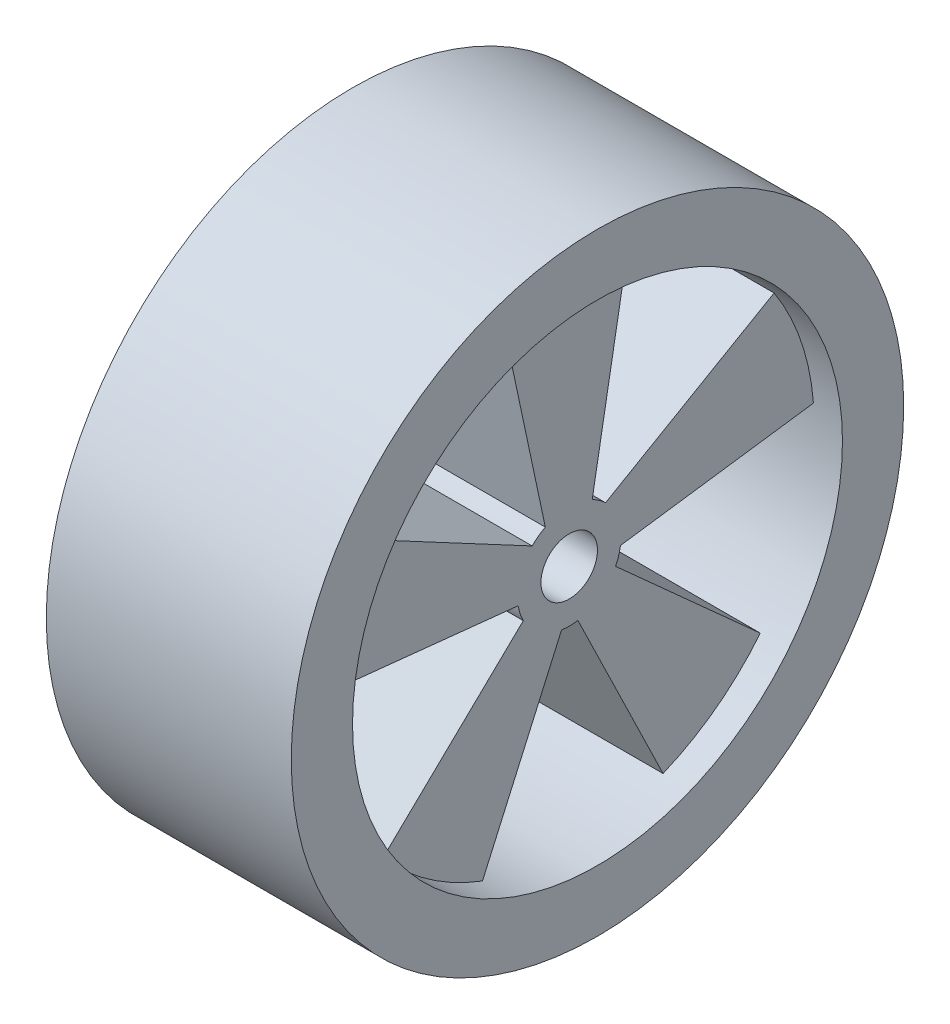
ISO-10303-21;
HEADER;
FILE_DESCRIPTION(('STEP AP214'),'2;1');
FILE_NAME('part.step','',(''),(''),'','','');
FILE_SCHEMA(('AUTOMOTIVE_DESIGN { 1 0 10303 214 1 1 1 1 }'));
ENDSEC;
DATA;
#1=APPLICATION_CONTEXT('core data for automotive mechanical design processes');
#2=APPLICATION_PROTOCOL_DEFINITION('international standard','automotive_design',2000,#1);
#3=PRODUCT_CONTEXT('',#1,'mechanical');
#4=PRODUCT('Part','Part','',(#3));
#5=PRODUCT_RELATED_PRODUCT_CATEGORY('part','',(#4));
#6=PRODUCT_DEFINITION_FORMATION('','',#4);
#7=PRODUCT_DEFINITION_CONTEXT('part definition',#1,'design');
#8=PRODUCT_DEFINITION('design','',#6,#7);
#9=PRODUCT_DEFINITION_SHAPE('','',#8);
#10=(LENGTH_UNIT() NAMED_UNIT(*) SI_UNIT(.MILLI.,.METRE.));
#11=(NAMED_UNIT(*) PLANE_ANGLE_UNIT() SI_UNIT($,.RADIAN.));
#12=(NAMED_UNIT(*) SI_UNIT($,.STERADIAN.) SOLID_ANGLE_UNIT());
#13=UNCERTAINTY_MEASURE_WITH_UNIT(LENGTH_MEASURE(1.E-05),#10,'distance_accuracy_value','');
#14=(GEOMETRIC_REPRESENTATION_CONTEXT(3) GLOBAL_UNCERTAINTY_ASSIGNED_CONTEXT((#13)) GLOBAL_UNIT_ASSIGNED_CONTEXT((#10,
#11,#12)) REPRESENTATION_CONTEXT('',''));
#15=CARTESIAN_POINT('',(0.,0.,0.));
#16=DIRECTION('',(0.,0.,1.));
#17=DIRECTION('',(1.,0.,0.));
#18=AXIS2_PLACEMENT_3D('',#15,#16,#17);
#19=CARTESIAN_POINT('',(78.,-2.97640639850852,-6.69374221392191));
#20=DIRECTION('',(0.,0.406299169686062,0.913740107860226));
#21=DIRECTION('',(0.,-0.913740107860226,0.406299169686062));
#22=AXIS2_PLACEMENT_3D('',#19,#20,#21);
#23=PLANE('',#22);
#24=DIRECTION('',(0.,0.913740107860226,-0.406299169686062));
#25=VECTOR('',#24,1.);
#26=CARTESIAN_POINT('',(63.,-2.97640639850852,-6.69374221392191));
#27=LINE('',#26,#25);
#28=CARTESIAN_POINT('',(63.,-121.573870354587,46.0412211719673));
#29=VERTEX_POINT('',#28);
#30=CARTESIAN_POINT('',(63.,-27.1962909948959,4.07575221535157));
#31=VERTEX_POINT('',#30);
#32=EDGE_CURVE('E333',#29,#31,#27,.T.);
#33=ORIENTED_EDGE('',*,*,#32,.F.);
#34=DIRECTION('',(-1.,0.,0.));
#35=VECTOR('',#34,1.);
#36=CARTESIAN_POINT('',(78.,-121.573870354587,46.0412211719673));
#37=LINE('',#36,#35);
#38=CARTESIAN_POINT('',(-37.,-121.573870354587,46.0412211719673));
#39=VERTEX_POINT('',#38);
#40=EDGE_CURVE('E270',#29,#39,#37,.T.);
#41=ORIENTED_EDGE('',*,*,#40,.T.);
#42=DIRECTION('',(0.,0.913740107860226,-0.406299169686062));
#43=VECTOR('',#42,1.);
#44=CARTESIAN_POINT('',(-37.,-2.97640639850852,-6.69374221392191));
#45=LINE('',#44,#43);
#46=CARTESIAN_POINT('',(-37.,-27.1962909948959,4.07575221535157));
#47=VERTEX_POINT('',#46);
#48=EDGE_CURVE('E344',#39,#47,#45,.T.);
#49=ORIENTED_EDGE('',*,*,#48,.T.);
#50=DIRECTION('',(-1.,0.,0.));
#51=VECTOR('',#50,1.);
#52=CARTESIAN_POINT('',(78.,-27.1962909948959,4.07575221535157));
#53=LINE('',#52,#51);
#54=EDGE_CURVE('E12',#31,#47,#53,.T.);
#55=ORIENTED_EDGE('',*,*,#54,.F.);
#56=EDGE_LOOP('',(#33,#41,#49,#55));
#57=FACE_BOUND('',#56,.T.);
#58=ADVANCED_FACE('F42',(#57),#23,.F.);
#59=CARTESIAN_POINT('',(78.,0.,0.));
#60=DIRECTION('',(-1.,0.,0.));
#61=DIRECTION('',(0.,0.,1.));
#62=AXIS2_PLACEMENT_3D('',#59,#60,#61);
#63=CYLINDRICAL_SURFACE('',#62,27.5);
#64=CARTESIAN_POINT('',(63.,0.,0.));
#65=DIRECTION('',(1.,0.,0.));
#66=DIRECTION('',(0.,0.,-1.));
#67=AXIS2_PLACEMENT_3D('',#64,#65,#66);
#68=CIRCLE('',#67,27.5);
#69=CARTESIAN_POINT('',(63.,-27.1115849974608,-4.60564424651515));
#70=VERTEX_POINT('',#69);
#71=EDGE_CURVE('E331',#31,#70,#68,.T.);
#72=ORIENTED_EDGE('',*,*,#71,.F.);
#73=ORIENTED_EDGE('',*,*,#54,.T.);
#74=CARTESIAN_POINT('',(-37.,0.,0.));
#75=DIRECTION('',(1.,0.,0.));
#76=DIRECTION('',(0.,0.,-1.));
#77=AXIS2_PLACEMENT_3D('',#74,#75,#76);
#78=CIRCLE('',#77,27.5);
#79=CARTESIAN_POINT('',(-37.,-27.1115849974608,-4.60564424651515));
#80=VERTEX_POINT('',#79);
#81=EDGE_CURVE('E337',#47,#80,#78,.T.);
#82=ORIENTED_EDGE('',*,*,#81,.T.);
#83=DIRECTION('',(-1.,0.,0.));
#84=VECTOR('',#83,1.);
#85=CARTESIAN_POINT('',(78.,-27.1115849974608,-4.60564424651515));
#86=LINE('',#85,#84);
#87=EDGE_CURVE('E51',#70,#80,#86,.T.);
#88=ORIENTED_EDGE('',*,*,#87,.F.);
#89=EDGE_LOOP('',(#72,#73,#82,#88));
#90=FACE_BOUND('',#89,.T.);
#91=ADVANCED_FACE('F401',(#90),#63,.T.);
#92=CARTESIAN_POINT('',(78.,-3.37102331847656,6.93476288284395));
#93=DIRECTION('',(0.,-0.437188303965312,0.899369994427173));
#94=DIRECTION('',(0.,-0.899369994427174,-0.437188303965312));
#95=AXIS2_PLACEMENT_3D('',#92,#93,#94);
#96=PLANE('',#95);
#97=DIRECTION('',(-1.,0.,0.));
#98=VECTOR('',#97,1.);
#99=CARTESIAN_POINT('',(78.,-120.083280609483,-49.7996558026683));
#100=LINE('',#99,#98);
#101=CARTESIAN_POINT('',(63.,-120.083280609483,-49.7996558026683));
#102=VERTEX_POINT('',#101);
#103=CARTESIAN_POINT('',(-37.,-120.083280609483,-49.7996558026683));
#104=VERTEX_POINT('',#103);
#105=EDGE_CURVE('E272',#102,#104,#100,.T.);
#106=ORIENTED_EDGE('',*,*,#105,.F.);
#107=DIRECTION('',(0.,0.899369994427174,0.437188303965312));
#108=VECTOR('',#107,1.);
#109=CARTESIAN_POINT('',(63.,-3.37102331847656,6.93476288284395));
#110=LINE('',#109,#108);
#111=EDGE_CURVE('E328',#102,#70,#110,.T.);
#112=ORIENTED_EDGE('',*,*,#111,.T.);
#113=ORIENTED_EDGE('',*,*,#87,.T.);
#114=DIRECTION('',(0.,0.899369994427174,0.437188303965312));
#115=VECTOR('',#114,1.);
#116=CARTESIAN_POINT('',(-37.,-3.37102331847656,6.93476288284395));
#117=LINE('',#116,#115);
#118=EDGE_CURVE('E338',#104,#80,#117,.T.);
#119=ORIENTED_EDGE('',*,*,#118,.F.);
#120=EDGE_LOOP('',(#106,#112,#113,#119));
#121=FACE_BOUND('',#120,.T.);
#122=ADVANCED_FACE('F396',(#121),#96,.T.);
#123=CARTESIAN_POINT('',(78.,-7.28588731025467,0.762250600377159));
#124=DIRECTION('',(0.,0.994571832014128,-0.104052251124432));
#125=DIRECTION('',(0.,0.104052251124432,0.994571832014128));
#126=AXIS2_PLACEMENT_3D('',#123,#124,#125);
#127=PLANE('',#126);
#128=DIRECTION('',(0.,-0.104052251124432,-0.994571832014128));
#129=VECTOR('',#128,1.);
#130=CARTESIAN_POINT('',(63.,-7.28588731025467,0.762250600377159));
#131=LINE('',#130,#129);
#132=CARTESIAN_POINT('',(63.,6.219411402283,129.851141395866));
#133=VERTEX_POINT('',#132);
#134=CARTESIAN_POINT('',(63.,-4.52784539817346,27.1246864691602));
#135=VERTEX_POINT('',#134);
#136=EDGE_CURVE('E326',#133,#135,#131,.T.);
#137=ORIENTED_EDGE('',*,*,#136,.F.);
#138=DIRECTION('',(-1.,0.,0.));
#139=VECTOR('',#138,1.);
#140=CARTESIAN_POINT('',(78.,6.219411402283,129.851141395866));
#141=LINE('',#140,#139);
#142=CARTESIAN_POINT('',(-37.,6.219411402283,129.851141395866));
#143=VERTEX_POINT('',#142);
#144=EDGE_CURVE('E275',#133,#143,#141,.T.);
#145=ORIENTED_EDGE('',*,*,#144,.T.);
#146=DIRECTION('',(0.,-0.104052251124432,-0.994571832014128));
#147=VECTOR('',#146,1.);
#148=CARTESIAN_POINT('',(-37.,-7.28588731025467,0.762250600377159));
#149=LINE('',#148,#147);
#150=CARTESIAN_POINT('',(-37.,-4.52784539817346,27.1246864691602));
#151=VERTEX_POINT('',#150);
#152=EDGE_CURVE('E256',#143,#151,#149,.T.);
#153=ORIENTED_EDGE('',*,*,#152,.T.);
#154=DIRECTION('',(-1.,0.,0.));
#155=VECTOR('',#154,1.);
#156=CARTESIAN_POINT('',(78.,-4.52784539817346,27.1246864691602));
#157=LINE('',#156,#155);
#158=EDGE_CURVE('E59',#135,#151,#157,.T.);
#159=ORIENTED_EDGE('',*,*,#158,.F.);
#160=EDGE_LOOP('',(#137,#145,#153,#159));
#161=FACE_BOUND('',#160,.T.);
#162=ADVANCED_FACE('F412',(#161),#127,.F.);
#163=CARTESIAN_POINT('',(63.,0.,0.));
#164=DIRECTION('',(1.,0.,0.));
#165=DIRECTION('',(0.,0.,-1.));
#166=AXIS2_PLACEMENT_3D('',#163,#164,#165);
#167=CIRCLE('',#166,27.5);
#168=CARTESIAN_POINT('',(63.,-12.7581684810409,24.3614272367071));
#169=VERTEX_POINT('',#168);
#170=EDGE_CURVE('E324',#135,#169,#167,.T.);
#171=ORIENTED_EDGE('',*,*,#170,.F.);
#172=ORIENTED_EDGE('',*,*,#158,.T.);
#173=CARTESIAN_POINT('',(-37.,0.,0.));
#174=DIRECTION('',(1.,0.,0.));
#175=DIRECTION('',(0.,0.,-1.));
#176=AXIS2_PLACEMENT_3D('',#173,#174,#175);
#177=CIRCLE('',#176,27.5);
#178=CARTESIAN_POINT('',(-37.,-12.7581684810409,24.3614272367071));
#179=VERTEX_POINT('',#178);
#180=EDGE_CURVE('E254',#151,#179,#177,.T.);
#181=ORIENTED_EDGE('',*,*,#180,.T.);
#182=DIRECTION('',(-1.,0.,0.));
#183=VECTOR('',#182,1.);
#184=CARTESIAN_POINT('',(78.,-12.7581684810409,24.3614272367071));
#185=LINE('',#184,#183);
#186=EDGE_CURVE('E67',#169,#179,#185,.T.);
#187=ORIENTED_EDGE('',*,*,#186,.F.);
#188=EDGE_LOOP('',(#171,#172,#181,#187));
#189=FACE_BOUND('',#188,.T.);
#190=ADVANCED_FACE('F414',(#189),#63,.T.);
#191=CARTESIAN_POINT('',(78.,5.55364793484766,5.34899327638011));
#192=DIRECTION('',(0.,0.720253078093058,0.693711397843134));
#193=DIRECTION('',(0.,-0.693711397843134,0.720253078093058));
#194=AXIS2_PLACEMENT_3D('',#191,#192,#193);
#195=PLANE('',#194);
#196=DIRECTION('',(-1.,0.,0.));
#197=VECTOR('',#196,1.);
#198=CARTESIAN_POINT('',(78.,-84.4700616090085,98.8170465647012));
#199=LINE('',#198,#197);
#200=CARTESIAN_POINT('',(63.,-84.4700616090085,98.8170465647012));
#201=VERTEX_POINT('',#200);
#202=CARTESIAN_POINT('',(-37.,-84.4700616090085,98.8170465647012));
#203=VERTEX_POINT('',#202);
#204=EDGE_CURVE('E277',#201,#203,#199,.T.);
#205=ORIENTED_EDGE('',*,*,#204,.F.);
#206=DIRECTION('',(0.,0.693711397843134,-0.720253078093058));
#207=VECTOR('',#206,1.);
#208=CARTESIAN_POINT('',(63.,5.55364793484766,5.34899327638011));
#209=LINE('',#208,#207);
#210=EDGE_CURVE('E322',#201,#169,#209,.T.);
#211=ORIENTED_EDGE('',*,*,#210,.T.);
#212=ORIENTED_EDGE('',*,*,#186,.T.);
#213=DIRECTION('',(0.,0.693711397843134,-0.720253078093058));
#214=VECTOR('',#213,1.);
#215=CARTESIAN_POINT('',(-37.,5.55364793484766,5.34899327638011));
#216=LINE('',#215,#214);
#217=EDGE_CURVE('E252',#203,#179,#216,.T.);
#218=ORIENTED_EDGE('',*,*,#217,.F.);
#219=EDGE_LOOP('',(#205,#211,#212,#218));
#220=FACE_BOUND('',#219,.T.);
#221=ADVANCED_FACE('F406',(#220),#195,.T.);
#222=CARTESIAN_POINT('',(78.,-1.52651959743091,7.16483899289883));
#223=DIRECTION('',(0.,0.208380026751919,-0.978047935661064));
#224=DIRECTION('',(0.,0.978047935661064,0.208380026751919));
#225=AXIS2_PLACEMENT_3D('',#222,#223,#224);
#226=PLANE('',#225);
#227=DIRECTION('',(0.,-0.978047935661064,-0.208380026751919));
#228=VECTOR('',#227,1.);
#229=CARTESIAN_POINT('',(63.,-1.52651959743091,7.16483899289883));
#230=LINE('',#229,#228);
#231=CARTESIAN_POINT('',(63.,125.417677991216,34.2111976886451));
#232=VERTEX_POINT('',#231);
#233=CARTESIAN_POINT('',(63.,24.3979286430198,12.6882259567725));
#234=VERTEX_POINT('',#233);
#235=EDGE_CURVE('E320',#232,#234,#230,.T.);
#236=ORIENTED_EDGE('',*,*,#235,.F.);
#237=DIRECTION('',(-1.,0.,0.));
#238=VECTOR('',#237,1.);
#239=CARTESIAN_POINT('',(78.,125.417677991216,34.2111976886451));
#240=LINE('',#239,#238);
#241=CARTESIAN_POINT('',(-37.,125.417677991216,34.2111976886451));
#242=VERTEX_POINT('',#241);
#243=EDGE_CURVE('E282',#232,#242,#240,.T.);
#244=ORIENTED_EDGE('',*,*,#243,.T.);
#245=DIRECTION('',(0.,-0.978047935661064,-0.208380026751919));
#246=VECTOR('',#245,1.);
#247=CARTESIAN_POINT('',(-37.,-1.52651959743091,7.16483899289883));
#248=LINE('',#247,#246);
#249=CARTESIAN_POINT('',(-37.,24.3979286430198,12.6882259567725));
#250=VERTEX_POINT('',#249);
#251=EDGE_CURVE('E249',#242,#250,#248,.T.);
#252=ORIENTED_EDGE('',*,*,#251,.T.);
#253=DIRECTION('',(-1.,0.,0.));
#254=VECTOR('',#253,1.);
#255=CARTESIAN_POINT('',(78.,24.3979286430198,12.6882259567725));
#256=LINE('',#255,#254);
#257=EDGE_CURVE('E278',#234,#250,#256,.T.);
#258=ORIENTED_EDGE('',*,*,#257,.F.);
#259=EDGE_LOOP('',(#236,#244,#252,#258));
#260=FACE_BOUND('',#259,.T.);
#261=ADVANCED_FACE('F374',(#260),#226,.F.);
#262=CARTESIAN_POINT('',(63.,0.,0.));
#263=DIRECTION('',(1.,0.,0.));
#264=DIRECTION('',(0.,0.,-1.));
#265=AXIS2_PLACEMENT_3D('',#262,#263,#264);
#266=CIRCLE('',#265,27.5);
#267=CARTESIAN_POINT('',(63.,19.2266032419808,19.6618342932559));
#268=VERTEX_POINT('',#267);
#269=EDGE_CURVE('E313',#234,#268,#266,.T.);
#270=ORIENTED_EDGE('',*,*,#269,.F.);
#271=ORIENTED_EDGE('',*,*,#257,.T.);
#272=CARTESIAN_POINT('',(-37.,0.,0.));
#273=DIRECTION('',(1.,0.,0.));
#274=DIRECTION('',(0.,0.,-1.));
#275=AXIS2_PLACEMENT_3D('',#272,#273,#274);
#276=CIRCLE('',#275,27.5);
#277=CARTESIAN_POINT('',(-37.,19.2266032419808,19.6618342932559));
#278=VERTEX_POINT('',#277);
#279=EDGE_CURVE('E246',#250,#278,#276,.T.);
#280=ORIENTED_EDGE('',*,*,#279,.T.);
#281=DIRECTION('',(-1.,0.,0.));
#282=VECTOR('',#281,1.);
#283=CARTESIAN_POINT('',(78.,19.2266032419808,19.6618342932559));
#284=LINE('',#283,#282);
#285=EDGE_CURVE('E287',#268,#278,#284,.T.);
#286=ORIENTED_EDGE('',*,*,#285,.F.);
#287=EDGE_LOOP('',(#270,#271,#280,#286));
#288=FACE_BOUND('',#287,.T.);
#289=ADVANCED_FACE('F369',(#288),#63,.T.);
#290=CARTESIAN_POINT('',(78.,6.80336650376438,-3.62890323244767));
#291=DIRECTION('',(0.,0.882329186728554,-0.470632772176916));
#292=DIRECTION('',(0.,0.470632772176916,0.882329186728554));
#293=AXIS2_PLACEMENT_3D('',#290,#291,#292);
#294=PLANE('',#293);
#295=DIRECTION('',(-1.,0.,0.));
#296=VECTOR('',#295,1.);
#297=CARTESIAN_POINT('',(78.,67.8779115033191,110.871949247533));
#298=LINE('',#297,#296);
#299=CARTESIAN_POINT('',(63.,67.8779115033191,110.871949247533));
#300=VERTEX_POINT('',#299);
#301=CARTESIAN_POINT('',(-37.,67.8779115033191,110.871949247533));
#302=VERTEX_POINT('',#301);
#303=EDGE_CURVE('E284',#300,#302,#298,.T.);
#304=ORIENTED_EDGE('',*,*,#303,.F.);
#305=DIRECTION('',(0.,-0.470632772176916,-0.882329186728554));
#306=VECTOR('',#305,1.);
#307=CARTESIAN_POINT('',(63.,6.80336650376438,-3.62890323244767));
#308=LINE('',#307,#306);
#309=EDGE_CURVE('E310',#300,#268,#308,.T.);
#310=ORIENTED_EDGE('',*,*,#309,.T.);
#311=ORIENTED_EDGE('',*,*,#285,.T.);
#312=DIRECTION('',(0.,-0.470632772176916,-0.882329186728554));
#313=VECTOR('',#312,1.);
#314=CARTESIAN_POINT('',(-37.,6.80336650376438,-3.62890323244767));
#315=LINE('',#314,#313);
#316=EDGE_CURVE('E243',#302,#278,#315,.T.);
#317=ORIENTED_EDGE('',*,*,#316,.F.);
#318=EDGE_LOOP('',(#304,#310,#311,#317));
#319=FACE_BOUND('',#318,.T.);
#320=ADVANCED_FACE('F365',(#319),#294,.T.);
#321=CARTESIAN_POINT('',(78.,6.34244631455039,3.66586342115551));
#322=DIRECTION('',(0.,-0.865785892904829,-0.500414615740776));
#323=DIRECTION('',(0.,0.500414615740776,-0.865785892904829));
#324=AXIS2_PLACEMENT_3D('',#321,#322,#323);
#325=PLANE('',#324);
#326=DIRECTION('',(0.,-0.500414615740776,0.865785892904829));
#327=VECTOR('',#326,1.);
#328=CARTESIAN_POINT('',(63.,6.34244631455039,3.66586342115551));
#329=LINE('',#328,#327);
#330=CARTESIAN_POINT('',(63.,71.2929763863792,-108.707458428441));
#331=VERTEX_POINT('',#330);
#332=CARTESIAN_POINT('',(63.,19.606594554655,-19.2829315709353));
#333=VERTEX_POINT('',#332);
#334=EDGE_CURVE('E309',#331,#333,#329,.T.);
#335=ORIENTED_EDGE('',*,*,#334,.F.);
#336=DIRECTION('',(-1.,0.,0.));
#337=VECTOR('',#336,1.);
#338=CARTESIAN_POINT('',(78.,71.2929763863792,-108.707458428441));
#339=LINE('',#338,#337);
#340=CARTESIAN_POINT('',(-37.,71.2929763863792,-108.707458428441));
#341=VERTEX_POINT('',#340);
#342=EDGE_CURVE('E201',#331,#341,#339,.T.);
#343=ORIENTED_EDGE('',*,*,#342,.T.);
#344=DIRECTION('',(0.,-0.500414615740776,0.865785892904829));
#345=VECTOR('',#344,1.);
#346=CARTESIAN_POINT('',(-37.,6.34244631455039,3.66586342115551));
#347=LINE('',#346,#345);
#348=CARTESIAN_POINT('',(-37.,19.606594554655,-19.2829315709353));
#349=VERTEX_POINT('',#348);
#350=EDGE_CURVE('E240',#341,#349,#347,.T.);
#351=ORIENTED_EDGE('',*,*,#350,.T.);
#352=DIRECTION('',(-1.,0.,0.));
#353=VECTOR('',#352,1.);
#354=CARTESIAN_POINT('',(78.,19.606594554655,-19.2829315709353));
#355=LINE('',#354,#353);
#356=EDGE_CURVE('E285',#333,#349,#355,.T.);
#357=ORIENTED_EDGE('',*,*,#356,.F.);
#358=EDGE_LOOP('',(#335,#343,#351,#357));
#359=FACE_BOUND('',#358,.T.);
#360=ADVANCED_FACE('F308',(#359),#325,.F.);
#361=CARTESIAN_POINT('',(63.,0.,0.));
#362=DIRECTION('',(1.,0.,0.));
#363=DIRECTION('',(0.,0.,-1.));
#364=AXIS2_PLACEMENT_3D('',#361,#362,#363);
#365=CIRCLE('',#364,27.5);
#366=CARTESIAN_POINT('',(63.,24.6408627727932,-12.2097453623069));
#367=VERTEX_POINT('',#366);
#368=EDGE_CURVE('E300',#333,#367,#365,.T.);
#369=ORIENTED_EDGE('',*,*,#368,.F.);
#370=ORIENTED_EDGE('',*,*,#356,.T.);
#371=CARTESIAN_POINT('',(-37.,0.,0.));
#372=DIRECTION('',(1.,0.,0.));
#373=DIRECTION('',(0.,0.,-1.));
#374=AXIS2_PLACEMENT_3D('',#371,#372,#373);
#375=CIRCLE('',#374,27.5);
#376=CARTESIAN_POINT('',(-37.,24.6408627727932,-12.2097453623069));
#377=VERTEX_POINT('',#376);
#378=EDGE_CURVE('E225',#349,#377,#375,.T.);
#379=ORIENTED_EDGE('',*,*,#378,.T.);
#380=DIRECTION('',(-1.,0.,0.));
#381=VECTOR('',#380,1.);
#382=CARTESIAN_POINT('',(78.,24.6408627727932,-12.2097453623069));
#383=LINE('',#382,#381);
#384=EDGE_CURVE('E293',#367,#377,#383,.T.);
#385=ORIENTED_EDGE('',*,*,#384,.F.);
#386=EDGE_LOOP('',(#369,#370,#379,#385));
#387=FACE_BOUND('',#386,.T.);
#388=ADVANCED_FACE('F298',(#387),#63,.T.);
#389=CARTESIAN_POINT('',(78.,-1.34893619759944,-7.5917788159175));
#390=DIRECTION('',(0.,-0.174943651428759,-0.984578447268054));
#391=DIRECTION('',(0.,0.984578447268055,-0.174943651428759));
#392=AXIS2_PLACEMENT_3D('',#389,#390,#391);
#393=PLANE('',#392);
#394=DIRECTION('',(-1.,0.,0.));
#395=VECTOR('',#394,1.);
#396=CARTESIAN_POINT('',(78.,126.420918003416,-30.2944135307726));
#397=LINE('',#396,#395);
#398=CARTESIAN_POINT('',(63.,126.420918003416,-30.2944135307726));
#399=VERTEX_POINT('',#398);
#400=CARTESIAN_POINT('',(-37.,126.420918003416,-30.2944135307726));
#401=VERTEX_POINT('',#400);
#402=EDGE_CURVE('E291',#399,#401,#397,.T.);
#403=ORIENTED_EDGE('',*,*,#402,.F.);
#404=DIRECTION('',(0.,-0.984578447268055,0.174943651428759));
#405=VECTOR('',#404,1.);
#406=CARTESIAN_POINT('',(63.,-1.34893619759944,-7.5917788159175));
#407=LINE('',#406,#405);
#408=EDGE_CURVE('E315',#399,#367,#407,.T.);
#409=ORIENTED_EDGE('',*,*,#408,.T.);
#410=ORIENTED_EDGE('',*,*,#384,.T.);
#411=DIRECTION('',(0.,-0.984578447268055,0.174943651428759));
#412=VECTOR('',#411,1.);
#413=CARTESIAN_POINT('',(-37.,-1.34893619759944,-7.5917788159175));
#414=LINE('',#413,#412);
#415=EDGE_CURVE('E220',#401,#377,#414,.T.);
#416=ORIENTED_EDGE('',*,*,#415,.F.);
#417=EDGE_LOOP('',(#403,#409,#410,#416));
#418=FACE_BOUND('',#417,.T.);
#419=ADVANCED_FACE('F379',(#418),#393,.T.);
#420=CARTESIAN_POINT('',(78.,5.44636699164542,-4.89921080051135));
#421=DIRECTION('',(0.,-0.74346513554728,0.668774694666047));
#422=DIRECTION('',(0.,-0.668774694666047,-0.74346513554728));
#423=AXIS2_PLACEMENT_3D('',#420,#421,#422);
#424=PLANE('',#423);
#425=DIRECTION('',(0.,0.668774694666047,0.74346513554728));
#426=VECTOR('',#425,1.);
#427=CARTESIAN_POINT('',(63.,5.44636699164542,-4.89921080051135));
#428=LINE('',#427,#426);
#429=CARTESIAN_POINT('',(63.,-81.3561954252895,-101.396101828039));
#430=VERTEX_POINT('',#429);
#431=CARTESIAN_POINT('',(63.,-12.2803868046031,-24.6057330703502));
#432=VERTEX_POINT('',#431);
#433=EDGE_CURVE('E381',#430,#432,#428,.T.);
#434=ORIENTED_EDGE('',*,*,#433,.F.);
#435=DIRECTION('',(-1.,0.,0.));
#436=VECTOR('',#435,1.);
#437=CARTESIAN_POINT('',(78.,-81.3561954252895,-101.396101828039));
#438=LINE('',#437,#436);
#439=CARTESIAN_POINT('',(-37.,-81.3561954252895,-101.396101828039));
#440=VERTEX_POINT('',#439);
#441=EDGE_CURVE('E210',#430,#440,#438,.T.);
#442=ORIENTED_EDGE('',*,*,#441,.T.);
#443=DIRECTION('',(0.,0.668774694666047,0.74346513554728));
#444=VECTOR('',#443,1.);
#445=CARTESIAN_POINT('',(-37.,5.44636699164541,-4.89921080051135));
#446=LINE('',#445,#444);
#447=CARTESIAN_POINT('',(-37.,-12.2803868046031,-24.6057330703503));
#448=VERTEX_POINT('',#447);
#449=EDGE_CURVE('E228',#440,#448,#446,.T.);
#450=ORIENTED_EDGE('',*,*,#449,.T.);
#451=DIRECTION('',(-1.,0.,0.));
#452=VECTOR('',#451,1.);
#453=CARTESIAN_POINT('',(78.,-12.2803868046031,-24.6057330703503));
#454=LINE('',#453,#452);
#455=EDGE_CURVE('E212',#432,#448,#454,.T.);
#456=ORIENTED_EDGE('',*,*,#455,.F.);
#457=EDGE_LOOP('',(#434,#442,#450,#456));
#458=FACE_BOUND('',#457,.T.);
#459=ADVANCED_FACE('F44',(#458),#424,.F.);
#460=CARTESIAN_POINT('',(63.,0.,0.));
#461=DIRECTION('',(1.,0.,0.));
#462=DIRECTION('',(0.,0.,-1.));
#463=AXIS2_PLACEMENT_3D('',#460,#461,#462);
#464=CIRCLE('',#463,27.5);
#465=CARTESIAN_POINT('',(63.,-3.99771253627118,-27.2078719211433));
#466=VERTEX_POINT('',#465);
#467=EDGE_CURVE('E189',#432,#466,#464,.T.);
#468=ORIENTED_EDGE('',*,*,#467,.F.);
#469=ORIENTED_EDGE('',*,*,#455,.T.);
#470=CARTESIAN_POINT('',(-37.,0.,0.));
#471=DIRECTION('',(1.,0.,0.));
#472=DIRECTION('',(0.,0.,-1.));
#473=AXIS2_PLACEMENT_3D('',#470,#471,#472);
#474=CIRCLE('',#473,27.5);
#475=CARTESIAN_POINT('',(-37.,-3.99771253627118,-27.2078719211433));
#476=VERTEX_POINT('',#475);
#477=EDGE_CURVE('E221',#448,#476,#474,.T.);
#478=ORIENTED_EDGE('',*,*,#477,.T.);
#479=DIRECTION('',(-1.,0.,0.));
#480=VECTOR('',#479,1.);
#481=CARTESIAN_POINT('',(78.,-3.99771253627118,-27.2078719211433));
#482=LINE('',#481,#480);
#483=EDGE_CURVE('E209',#466,#476,#482,.T.);
#484=ORIENTED_EDGE('',*,*,#483,.F.);
#485=EDGE_LOOP('',(#468,#469,#478,#484));
#486=FACE_BOUND('',#485,.T.);
#487=ADVANCED_FACE('F389',(#486),#63,.T.);
#488=CARTESIAN_POINT('',(78.,-7.63705492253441,-1.06307411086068));
#489=DIRECTION('',(0.,-0.990450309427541,-0.137870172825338));
#490=DIRECTION('',(0.,0.137870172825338,-0.990450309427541));
#491=AXIS2_PLACEMENT_3D('',#488,#489,#490);
#492=PLANE('',#491);
#493=DIRECTION('',(-1.,0.,0.));
#494=VECTOR('',#493,1.);
#495=CARTESIAN_POINT('',(78.,10.2545127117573,-129.594926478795));
#496=LINE('',#495,#494);
#497=CARTESIAN_POINT('',(63.,10.2545127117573,-129.594926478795));
#498=VERTEX_POINT('',#497);
#499=CARTESIAN_POINT('',(-37.,10.2545127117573,-129.594926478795));
#500=VERTEX_POINT('',#499);
#501=EDGE_CURVE('E199',#498,#500,#496,.T.);
#502=ORIENTED_EDGE('',*,*,#501,.F.);
#503=DIRECTION('',(0.,-0.137870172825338,0.990450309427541));
#504=VECTOR('',#503,1.);
#505=CARTESIAN_POINT('',(63.,-7.63705492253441,-1.06307411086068));
#506=LINE('',#505,#504);
#507=EDGE_CURVE('E183',#498,#466,#506,.T.);
#508=ORIENTED_EDGE('',*,*,#507,.T.);
#509=ORIENTED_EDGE('',*,*,#483,.T.);
#510=DIRECTION('',(0.,-0.137870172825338,0.990450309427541));
#511=VECTOR('',#510,1.);
#512=CARTESIAN_POINT('',(-37.,-7.6370549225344,-1.06307411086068));
#513=LINE('',#512,#511);
#514=EDGE_CURVE('E208',#500,#476,#513,.T.);
#515=ORIENTED_EDGE('',*,*,#514,.F.);
#516=EDGE_LOOP('',(#502,#508,#509,#515));
#517=FACE_BOUND('',#516,.T.);
#518=ADVANCED_FACE('F206',(#517),#492,.T.);
#519=CARTESIAN_POINT('',(78.,0.,0.));
#520=DIRECTION('',(-1.,0.,0.));
#521=DIRECTION('',(0.,0.,1.));
#522=AXIS2_PLACEMENT_3D('',#519,#520,#521);
#523=CYLINDRICAL_SURFACE('',#522,15.);
#524=CARTESIAN_POINT('',(-37.,0.,0.));
#525=DIRECTION('',(1.,0.,0.));
#526=DIRECTION('',(0.,0.,-1.));
#527=AXIS2_PLACEMENT_3D('',#524,#525,#526);
#528=CIRCLE('',#527,15.);
#529=CARTESIAN_POINT('',(-37.,0.,15.));
#530=VERTEX_POINT('',#529);
#531=EDGE_CURVE('E218',#530,#530,#528,.T.);
#532=CARTESIAN_POINT('',(63.,0.,0.));
#533=DIRECTION('',(1.,0.,0.));
#534=DIRECTION('',(0.,0.,-1.));
#535=AXIS2_PLACEMENT_3D('',#532,#533,#534);
#536=CIRCLE('',#535,15.);
#537=CARTESIAN_POINT('',(63.,0.,15.));
#538=VERTEX_POINT('',#537);
#539=EDGE_CURVE('E46',#538,#538,#536,.T.);
#540=CARTESIAN_POINT('',(-37.,0.,15.));
#541=CARTESIAN_POINT('',(-35.9583333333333,0.,15.));
#542=CARTESIAN_POINT('',(-34.9166666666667,0.,15.));
#543=CARTESIAN_POINT('',(-32.8333333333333,0.,15.));
#544=CARTESIAN_POINT('',(-31.7916666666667,0.,15.));
#545=CARTESIAN_POINT('',(-29.7083333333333,0.,15.));
#546=CARTESIAN_POINT('',(-28.6666666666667,0.,15.));
#547=CARTESIAN_POINT('',(-26.5833333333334,0.,15.));
#548=CARTESIAN_POINT('',(-25.5416666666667,0.,15.));
#549=CARTESIAN_POINT('',(-23.4583333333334,0.,15.));
#550=CARTESIAN_POINT('',(-22.4166666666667,0.,15.));
#551=CARTESIAN_POINT('',(-20.3333333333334,0.,15.));
#552=CARTESIAN_POINT('',(-19.2916666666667,0.,15.));
#553=CARTESIAN_POINT('',(-17.2083333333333,0.,15.));
#554=CARTESIAN_POINT('',(-16.1666666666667,0.,15.));
#555=CARTESIAN_POINT('',(-14.0833333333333,0.,15.));
#556=CARTESIAN_POINT('',(-13.0416666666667,0.,15.));
#557=CARTESIAN_POINT('',(-10.9583333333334,0.,15.));
#558=CARTESIAN_POINT('',(-9.91666666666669,0.,15.));
#559=CARTESIAN_POINT('',(-7.83333333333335,0.,15.));
#560=CARTESIAN_POINT('',(-6.79166666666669,0.,15.));
#561=CARTESIAN_POINT('',(-4.70833333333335,0.,15.));
#562=CARTESIAN_POINT('',(-3.66666666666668,0.,15.));
#563=CARTESIAN_POINT('',(-1.58333333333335,0.,15.));
#564=CARTESIAN_POINT('',(-0.541666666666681,0.,15.));
#565=CARTESIAN_POINT('',(1.54166666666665,0.,15.));
#566=CARTESIAN_POINT('',(2.58333333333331,0.,15.));
#567=CARTESIAN_POINT('',(4.66666666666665,0.,15.));
#568=CARTESIAN_POINT('',(5.70833333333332,0.,15.));
#569=CARTESIAN_POINT('',(7.79166666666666,0.,15.));
#570=CARTESIAN_POINT('',(8.83333333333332,0.,15.));
#571=CARTESIAN_POINT('',(10.9166666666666,0.,15.));
#572=CARTESIAN_POINT('',(11.9583333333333,0.,15.));
#573=CARTESIAN_POINT('',(14.0416666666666,0.,15.));
#574=CARTESIAN_POINT('',(15.0833333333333,0.,15.));
#575=CARTESIAN_POINT('',(17.1666666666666,0.,15.));
#576=CARTESIAN_POINT('',(18.2083333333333,0.,15.));
#577=CARTESIAN_POINT('',(20.2916666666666,0.,15.));
#578=CARTESIAN_POINT('',(21.3333333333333,0.,15.));
#579=CARTESIAN_POINT('',(23.4166666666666,0.,15.));
#580=CARTESIAN_POINT('',(24.4583333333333,0.,15.));
#581=CARTESIAN_POINT('',(26.5416666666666,0.,15.));
#582=CARTESIAN_POINT('',(27.5833333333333,0.,15.));
#583=CARTESIAN_POINT('',(29.6666666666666,0.,15.));
#584=CARTESIAN_POINT('',(30.7083333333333,0.,15.));
#585=CARTESIAN_POINT('',(32.7916666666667,0.,15.));
#586=CARTESIAN_POINT('',(33.8333333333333,0.,15.));
#587=CARTESIAN_POINT('',(35.9166666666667,0.,15.));
#588=CARTESIAN_POINT('',(36.9583333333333,0.,15.));
#589=CARTESIAN_POINT('',(39.0416666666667,0.,15.));
#590=CARTESIAN_POINT('',(40.0833333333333,0.,15.));
#591=CARTESIAN_POINT('',(42.1666666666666,0.,15.));
#592=CARTESIAN_POINT('',(43.2083333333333,0.,15.));
#593=CARTESIAN_POINT('',(45.2916666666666,0.,15.));
#594=CARTESIAN_POINT('',(46.3333333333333,0.,15.));
#595=CARTESIAN_POINT('',(48.4166666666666,0.,15.));
#596=CARTESIAN_POINT('',(49.4583333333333,0.,15.));
#597=CARTESIAN_POINT('',(51.5416666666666,0.,15.));
#598=CARTESIAN_POINT('',(52.5833333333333,0.,15.));
#599=CARTESIAN_POINT('',(54.6666666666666,0.,15.));
#600=CARTESIAN_POINT('',(55.7083333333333,0.,15.));
#601=CARTESIAN_POINT('',(57.7916666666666,0.,15.));
#602=CARTESIAN_POINT('',(58.8333333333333,0.,15.));
#603=CARTESIAN_POINT('',(60.9166666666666,0.,15.));
#604=CARTESIAN_POINT('',(61.9583333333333,0.,15.));
#605=CARTESIAN_POINT('',(63.,0.,15.));
#606=B_SPLINE_CURVE_WITH_KNOTS('',3,(#540,#541,#542,#543,#544,#545,#546,#547,#548,#549,#550,
#551,#552,#553,#554,#555,#556,#557,#558,#559,#560,#561,#562,#563,#564,#565,#566,#567,#568,#569,
#570,#571,#572,#573,#574,#575,#576,#577,#578,#579,#580,#581,#582,#583,#584,#585,#586,#587,#588,
#589,#590,#591,#592,#593,#594,#595,#596,#597,#598,#599,#600,#601,#602,#603,#604,#605),
.UNSPECIFIED.,.F.,.F.,(4,2,2,2,2,2,2,2,2,2,2,2,2,2,2,2,2,2,2,2,2,2,2,2,2,2,2,2,2,2,2,2,4),(0.,
3.125,6.25000000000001,9.37499999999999,12.5,15.625,18.75,21.875,25.,28.125,31.25,34.375,37.5,
40.625,43.75,46.875,50.,53.125,56.25,59.375,62.5,65.625,68.75,71.875,75.,78.125,81.25,84.375,
87.5,90.625,93.75,96.875,100.),.UNSPECIFIED.);
#607=EDGE_CURVE('BSEAM442',#530,#538,#606,.T.);
#608=ORIENTED_EDGE('',*,*,#531,.F.);
#609=ORIENTED_EDGE('',*,*,#539,.T.);
#610=ORIENTED_EDGE('',*,*,#607,.T.);
#611=ORIENTED_EDGE('',*,*,#607,.F.);
#612=EDGE_LOOP('',(#608,#610,#609,#611));
#613=FACE_BOUND('',#612,.T.);
#614=ADVANCED_FACE('F442',(#613),#523,.F.);
#615=CARTESIAN_POINT('',(78.,0.,0.));
#616=DIRECTION('',(-1.,0.,0.));
#617=DIRECTION('',(0.,0.,1.));
#618=AXIS2_PLACEMENT_3D('',#615,#616,#617);
#619=CYLINDRICAL_SURFACE('',#618,162.5);
#620=CARTESIAN_POINT('',(78.,0.,0.));
#621=DIRECTION('',(1.,0.,0.));
#622=DIRECTION('',(0.,0.,-1.));
#623=AXIS2_PLACEMENT_3D('',#620,#621,#622);
#624=CIRCLE('',#623,162.5);
#625=CARTESIAN_POINT('',(78.,0.,162.5));
#626=VERTEX_POINT('',#625);
#627=EDGE_CURVE('E214',#626,#626,#624,.T.);
#628=CARTESIAN_POINT('',(-52.,0.,0.));
#629=DIRECTION('',(1.,0.,0.));
#630=DIRECTION('',(0.,0.,-1.));
#631=AXIS2_PLACEMENT_3D('',#628,#629,#630);
#632=CIRCLE('',#631,162.5);
#633=CARTESIAN_POINT('',(-52.,0.,162.5));
#634=VERTEX_POINT('',#633);
#635=EDGE_CURVE('E263',#634,#634,#632,.T.);
#636=CARTESIAN_POINT('',(78.,0.,162.5));
#637=CARTESIAN_POINT('',(76.6458333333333,0.,162.5));
#638=CARTESIAN_POINT('',(75.2916666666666,0.,162.5));
#639=CARTESIAN_POINT('',(72.5833333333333,0.,162.5));
#640=CARTESIAN_POINT('',(71.2291666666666,0.,162.5));
#641=CARTESIAN_POINT('',(68.5208333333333,0.,162.5));
#642=CARTESIAN_POINT('',(67.1666666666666,0.,162.5));
#643=CARTESIAN_POINT('',(64.4583333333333,0.,162.5));
#644=CARTESIAN_POINT('',(63.1041666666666,0.,162.5));
#645=CARTESIAN_POINT('',(60.3958333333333,0.,162.5));
#646=CARTESIAN_POINT('',(59.0416666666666,0.,162.5));
#647=CARTESIAN_POINT('',(56.3333333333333,0.,162.5));
#648=CARTESIAN_POINT('',(54.9791666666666,0.,162.5));
#649=CARTESIAN_POINT('',(52.2708333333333,0.,162.5));
#650=CARTESIAN_POINT('',(50.9166666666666,0.,162.5));
#651=CARTESIAN_POINT('',(48.2083333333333,0.,162.5));
#652=CARTESIAN_POINT('',(46.8541666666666,0.,162.5));
#653=CARTESIAN_POINT('',(44.1458333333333,0.,162.5));
#654=CARTESIAN_POINT('',(42.7916666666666,0.,162.5));
#655=CARTESIAN_POINT('',(40.0833333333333,0.,162.5));
#656=CARTESIAN_POINT('',(38.7291666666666,0.,162.5));
#657=CARTESIAN_POINT('',(36.0208333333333,0.,162.5));
#658=CARTESIAN_POINT('',(34.6666666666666,0.,162.5));
#659=CARTESIAN_POINT('',(31.9583333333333,0.,162.5));
#660=CARTESIAN_POINT('',(30.6041666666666,0.,162.5));
#661=CARTESIAN_POINT('',(27.8958333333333,0.,162.5));
#662=CARTESIAN_POINT('',(26.5416666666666,0.,162.5));
#663=CARTESIAN_POINT('',(23.8333333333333,0.,162.5));
#664=CARTESIAN_POINT('',(22.4791666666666,0.,162.5));
#665=CARTESIAN_POINT('',(19.7708333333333,0.,162.5));
#666=CARTESIAN_POINT('',(18.4166666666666,0.,162.5));
#667=CARTESIAN_POINT('',(15.7083333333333,0.,162.5));
#668=CARTESIAN_POINT('',(14.3541666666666,0.,162.5));
#669=CARTESIAN_POINT('',(11.6458333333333,0.,162.5));
#670=CARTESIAN_POINT('',(10.2916666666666,0.,162.5));
#671=CARTESIAN_POINT('',(7.5833333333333,0.,162.5));
#672=CARTESIAN_POINT('',(6.22916666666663,0.,162.5));
#673=CARTESIAN_POINT('',(3.5208333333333,0.,162.5));
#674=CARTESIAN_POINT('',(2.16666666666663,0.,162.5));
#675=CARTESIAN_POINT('',(-0.541666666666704,0.,162.5));
#676=CARTESIAN_POINT('',(-1.89583333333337,0.,162.5));
#677=CARTESIAN_POINT('',(-4.60416666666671,0.,162.5));
#678=CARTESIAN_POINT('',(-5.95833333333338,0.,162.5));
#679=CARTESIAN_POINT('',(-8.66666666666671,0.,162.5));
#680=CARTESIAN_POINT('',(-10.0208333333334,0.,162.5));
#681=CARTESIAN_POINT('',(-12.7291666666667,0.,162.5));
#682=CARTESIAN_POINT('',(-14.0833333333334,0.,162.5));
#683=CARTESIAN_POINT('',(-16.7916666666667,0.,162.5));
#684=CARTESIAN_POINT('',(-18.1458333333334,0.,162.5));
#685=CARTESIAN_POINT('',(-20.8541666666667,0.,162.5));
#686=CARTESIAN_POINT('',(-22.2083333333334,0.,162.5));
#687=CARTESIAN_POINT('',(-24.9166666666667,0.,162.5));
#688=CARTESIAN_POINT('',(-26.2708333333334,0.,162.5));
#689=CARTESIAN_POINT('',(-28.9791666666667,0.,162.5));
#690=CARTESIAN_POINT('',(-30.3333333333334,0.,162.5));
#691=CARTESIAN_POINT('',(-33.0416666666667,0.,162.5));
#692=CARTESIAN_POINT('',(-34.3958333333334,0.,162.5));
#693=CARTESIAN_POINT('',(-37.1041666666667,0.,162.5));
#694=CARTESIAN_POINT('',(-38.4583333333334,0.,162.5));
#695=CARTESIAN_POINT('',(-41.1666666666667,0.,162.5));
#696=CARTESIAN_POINT('',(-42.5208333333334,0.,162.5));
#697=CARTESIAN_POINT('',(-45.2291666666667,0.,162.5));
#698=CARTESIAN_POINT('',(-46.5833333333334,0.,162.5));
#699=CARTESIAN_POINT('',(-49.2916666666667,0.,162.5));
#700=CARTESIAN_POINT('',(-50.6458333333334,0.,162.5));
#701=CARTESIAN_POINT('',(-52.,0.,162.5));
#702=B_SPLINE_CURVE_WITH_KNOTS('',3,(#636,#637,#638,#639,#640,#641,#642,#643,#644,#645,#646,
#647,#648,#649,#650,#651,#652,#653,#654,#655,#656,#657,#658,#659,#660,#661,#662,#663,#664,#665,
#666,#667,#668,#669,#670,#671,#672,#673,#674,#675,#676,#677,#678,#679,#680,#681,#682,#683,#684,
#685,#686,#687,#688,#689,#690,#691,#692,#693,#694,#695,#696,#697,#698,#699,#700,#701),
.UNSPECIFIED.,.F.,.F.,(4,2,2,2,2,2,2,2,2,2,2,2,2,2,2,2,2,2,2,2,2,2,2,2,2,2,2,2,2,2,2,2,4),(0.,
4.06250000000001,8.12500000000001,12.1875,16.25,20.3125,24.375,28.4375,32.5,36.5625,40.625,
44.6875,48.75,52.8125,56.875,60.9375,65.,69.0625,73.125,77.1875,81.25,85.3125,89.375,93.4375,
97.5,101.5625,105.625,109.6875,113.75,117.8125,121.875,125.9375,130.),.UNSPECIFIED.);
#703=EDGE_CURVE('BSEAM447',#626,#634,#702,.T.);
#704=ORIENTED_EDGE('',*,*,#627,.F.);
#705=ORIENTED_EDGE('',*,*,#635,.T.);
#706=ORIENTED_EDGE('',*,*,#703,.T.);
#707=ORIENTED_EDGE('',*,*,#703,.F.);
#708=EDGE_LOOP('',(#704,#706,#705,#707));
#709=FACE_BOUND('',#708,.T.);
#710=ADVANCED_FACE('F447',(#709),#619,.T.);
#711=CARTESIAN_POINT('',(78.,0.,0.));
#712=DIRECTION('',(-1.,0.,0.));
#713=DIRECTION('',(0.,0.,1.));
#714=AXIS2_PLACEMENT_3D('',#711,#712,#713);
#715=CYLINDRICAL_SURFACE('',#714,130.);
#716=ORIENTED_EDGE('',*,*,#40,.F.);
#717=CARTESIAN_POINT('',(63.,0.,0.));
#718=DIRECTION('',(1.,0.,0.));
#719=DIRECTION('',(0.,0.,-1.));
#720=AXIS2_PLACEMENT_3D('',#717,#718,#719);
#721=CIRCLE('',#720,130.);
#722=EDGE_CURVE('E408',#201,#29,#721,.T.);
#723=ORIENTED_EDGE('',*,*,#722,.F.);
#724=ORIENTED_EDGE('',*,*,#204,.T.);
#725=CARTESIAN_POINT('',(-37.,0.,0.));
#726=DIRECTION('',(1.,0.,0.));
#727=DIRECTION('',(0.,0.,-1.));
#728=AXIS2_PLACEMENT_3D('',#725,#726,#727);
#729=CIRCLE('',#728,130.);
#730=EDGE_CURVE('E341',#203,#39,#729,.T.);
#731=ORIENTED_EDGE('',*,*,#730,.T.);
#732=EDGE_LOOP('',(#716,#723,#724,#731));
#733=FACE_BOUND('',#732,.T.);
#734=EDGE_CURVE('E204',#102,#430,#721,.T.);
#735=ORIENTED_EDGE('',*,*,#734,.F.);
#736=ORIENTED_EDGE('',*,*,#105,.T.);
#737=CARTESIAN_POINT('',(-37.,0.,0.));
#738=DIRECTION('',(1.,0.,0.));
#739=DIRECTION('',(0.,0.,-1.));
#740=AXIS2_PLACEMENT_3D('',#737,#738,#739);
#741=CIRCLE('',#740,130.);
#742=EDGE_CURVE('E233',#104,#440,#741,.T.);
#743=ORIENTED_EDGE('',*,*,#742,.T.);
#744=ORIENTED_EDGE('',*,*,#441,.F.);
#745=EDGE_LOOP('',(#735,#736,#743,#744));
#746=FACE_BOUND('',#745,.T.);
#747=ORIENTED_EDGE('',*,*,#144,.F.);
#748=EDGE_CURVE('E409',#300,#133,#721,.T.);
#749=ORIENTED_EDGE('',*,*,#748,.F.);
#750=ORIENTED_EDGE('',*,*,#303,.T.);
#751=EDGE_CURVE('E349',#302,#143,#729,.T.);
#752=ORIENTED_EDGE('',*,*,#751,.T.);
#753=EDGE_LOOP('',(#747,#749,#750,#752));
#754=FACE_BOUND('',#753,.T.);
#755=ORIENTED_EDGE('',*,*,#243,.F.);
#756=EDGE_CURVE('E202',#399,#232,#721,.T.);
#757=ORIENTED_EDGE('',*,*,#756,.F.);
#758=ORIENTED_EDGE('',*,*,#402,.T.);
#759=EDGE_CURVE('E347',#401,#242,#729,.T.);
#760=ORIENTED_EDGE('',*,*,#759,.T.);
#761=EDGE_LOOP('',(#755,#757,#758,#760));
#762=FACE_BOUND('',#761,.T.);
#763=ORIENTED_EDGE('',*,*,#342,.F.);
#764=EDGE_CURVE('E186',#498,#331,#721,.T.);
#765=ORIENTED_EDGE('',*,*,#764,.F.);
#766=ORIENTED_EDGE('',*,*,#501,.T.);
#767=EDGE_CURVE('E346',#500,#341,#729,.T.);
#768=ORIENTED_EDGE('',*,*,#767,.T.);
#769=EDGE_LOOP('',(#763,#765,#766,#768));
#770=FACE_BOUND('',#769,.T.);
#771=CARTESIAN_POINT('',(78.,0.,0.));
#772=DIRECTION('',(1.,0.,0.));
#773=DIRECTION('',(0.,0.,-1.));
#774=AXIS2_PLACEMENT_3D('',#771,#772,#773);
#775=CIRCLE('',#774,130.);
#776=CARTESIAN_POINT('',(78.,0.,-130.));
#777=VERTEX_POINT('',#776);
#778=EDGE_CURVE('E260',#777,#777,#775,.T.);
#779=ORIENTED_EDGE('',*,*,#778,.T.);
#780=EDGE_LOOP('',(#779));
#781=FACE_BOUND('',#780,.T.);
#782=CARTESIAN_POINT('',(-52.,0.,0.));
#783=DIRECTION('',(1.,0.,0.));
#784=DIRECTION('',(0.,0.,-1.));
#785=AXIS2_PLACEMENT_3D('',#782,#783,#784);
#786=CIRCLE('',#785,130.);
#787=CARTESIAN_POINT('',(-52.,0.,-130.));
#788=VERTEX_POINT('',#787);
#789=EDGE_CURVE('E259',#788,#788,#786,.T.);
#790=ORIENTED_EDGE('',*,*,#789,.F.);
#791=EDGE_LOOP('',(#790));
#792=FACE_BOUND('',#791,.T.);
#793=ADVANCED_FACE('F196',(#733,#746,#754,#762,#770,#781,#792),#715,.F.);
#794=CARTESIAN_POINT('',(78.,0.,0.));
#795=DIRECTION('',(1.,0.,0.));
#796=DIRECTION('',(0.,0.,-1.));
#797=AXIS2_PLACEMENT_3D('',#794,#795,#796);
#798=PLANE('',#797);
#799=ORIENTED_EDGE('',*,*,#778,.F.);
#800=EDGE_LOOP('',(#799));
#801=FACE_BOUND('',#800,.T.);
#802=ORIENTED_EDGE('',*,*,#627,.T.);
#803=EDGE_LOOP('',(#802));
#804=FACE_BOUND('',#803,.T.);
#805=ADVANCED_FACE('F505',(#801,#804),#798,.T.);
#806=CARTESIAN_POINT('',(-52.,0.,0.));
#807=DIRECTION('',(1.,0.,0.));
#808=DIRECTION('',(0.,0.,-1.));
#809=AXIS2_PLACEMENT_3D('',#806,#807,#808);
#810=PLANE('',#809);
#811=ORIENTED_EDGE('',*,*,#789,.T.);
#812=EDGE_LOOP('',(#811));
#813=FACE_BOUND('',#812,.T.);
#814=ORIENTED_EDGE('',*,*,#635,.F.);
#815=EDGE_LOOP('',(#814));
#816=FACE_BOUND('',#815,.T.);
#817=ADVANCED_FACE('F517',(#813,#816),#810,.F.);
#818=CARTESIAN_POINT('',(-37.,0.,0.));
#819=DIRECTION('',(1.,0.,0.));
#820=DIRECTION('',(0.,0.,-1.));
#821=AXIS2_PLACEMENT_3D('',#818,#819,#820);
#822=PLANE('',#821);
#823=ORIENTED_EDGE('',*,*,#531,.T.);
#824=EDGE_LOOP('',(#823));
#825=FACE_BOUND('',#824,.T.);
#826=ORIENTED_EDGE('',*,*,#751,.F.);
#827=ORIENTED_EDGE('',*,*,#316,.T.);
#828=ORIENTED_EDGE('',*,*,#279,.F.);
#829=ORIENTED_EDGE('',*,*,#251,.F.);
#830=ORIENTED_EDGE('',*,*,#759,.F.);
#831=ORIENTED_EDGE('',*,*,#415,.T.);
#832=ORIENTED_EDGE('',*,*,#378,.F.);
#833=ORIENTED_EDGE('',*,*,#350,.F.);
#834=ORIENTED_EDGE('',*,*,#767,.F.);
#835=ORIENTED_EDGE('',*,*,#514,.T.);
#836=ORIENTED_EDGE('',*,*,#477,.F.);
#837=ORIENTED_EDGE('',*,*,#449,.F.);
#838=ORIENTED_EDGE('',*,*,#742,.F.);
#839=ORIENTED_EDGE('',*,*,#118,.T.);
#840=ORIENTED_EDGE('',*,*,#81,.F.);
#841=ORIENTED_EDGE('',*,*,#48,.F.);
#842=ORIENTED_EDGE('',*,*,#730,.F.);
#843=ORIENTED_EDGE('',*,*,#217,.T.);
#844=ORIENTED_EDGE('',*,*,#180,.F.);
#845=ORIENTED_EDGE('',*,*,#152,.F.);
#846=EDGE_LOOP('',(#826,#827,#828,#829,#830,#831,#832,#833,#834,#835,#836,#837,#838,#839,#840,
#841,#842,#843,#844,#845));
#847=FACE_BOUND('',#846,.T.);
#848=ADVANCED_FACE('F305',(#825,#847),#822,.F.);
#849=CARTESIAN_POINT('',(63.,0.,0.));
#850=DIRECTION('',(1.,0.,0.));
#851=DIRECTION('',(0.,0.,-1.));
#852=AXIS2_PLACEMENT_3D('',#849,#850,#851);
#853=PLANE('',#852);
#854=ORIENTED_EDGE('',*,*,#539,.F.);
#855=EDGE_LOOP('',(#854));
#856=FACE_BOUND('',#855,.T.);
#857=ORIENTED_EDGE('',*,*,#32,.T.);
#858=ORIENTED_EDGE('',*,*,#71,.T.);
#859=ORIENTED_EDGE('',*,*,#111,.F.);
#860=ORIENTED_EDGE('',*,*,#734,.T.);
#861=ORIENTED_EDGE('',*,*,#433,.T.);
#862=ORIENTED_EDGE('',*,*,#467,.T.);
#863=ORIENTED_EDGE('',*,*,#507,.F.);
#864=ORIENTED_EDGE('',*,*,#764,.T.);
#865=ORIENTED_EDGE('',*,*,#334,.T.);
#866=ORIENTED_EDGE('',*,*,#368,.T.);
#867=ORIENTED_EDGE('',*,*,#408,.F.);
#868=ORIENTED_EDGE('',*,*,#756,.T.);
#869=ORIENTED_EDGE('',*,*,#235,.T.);
#870=ORIENTED_EDGE('',*,*,#269,.T.);
#871=ORIENTED_EDGE('',*,*,#309,.F.);
#872=ORIENTED_EDGE('',*,*,#748,.T.);
#873=ORIENTED_EDGE('',*,*,#136,.T.);
#874=ORIENTED_EDGE('',*,*,#170,.T.);
#875=ORIENTED_EDGE('',*,*,#210,.F.);
#876=ORIENTED_EDGE('',*,*,#722,.T.);
#877=EDGE_LOOP('',(#857,#858,#859,#860,#861,#862,#863,#864,#865,#866,#867,#868,#869,#870,#871,
#872,#873,#874,#875,#876));
#878=FACE_BOUND('',#877,.T.);
#879=ADVANCED_FACE('F185',(#856,#878),#853,.T.);
#880=CLOSED_SHELL('',(#58,#91,#122,#162,#190,#221,#261,#289,#320,#360,#388,#419,#459,#487,#518,
#614,#710,#793,#805,#817,#848,#879));
#881=MANIFOLD_SOLID_BREP('B2',#880);
#882=ADVANCED_BREP_SHAPE_REPRESENTATION('',(#18,#881),#14);
#883=SHAPE_DEFINITION_REPRESENTATION(#9,#882);
ENDSEC;
END-ISO-10303-21;
